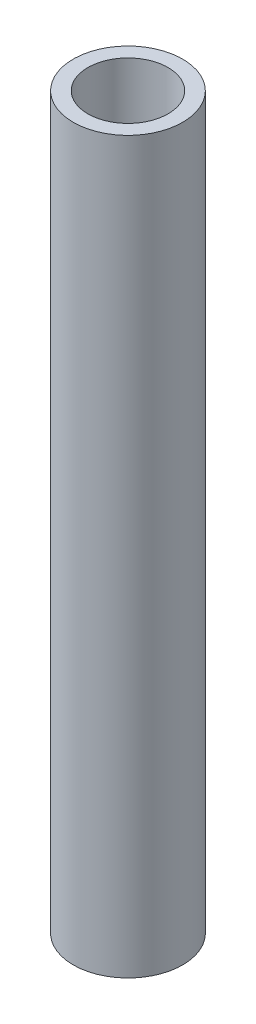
from build123d import *

# Parameters (mm, degrees)
SKETCH1_R      = 1.5
SKETCH1_R_2    = 1.1
EXTRUDE1_DEPTH = 20


with BuildPart() as part:
    # Sketch1 → Extrude1 (new body)
    with BuildSketch(Plane(origin=(0, 0, 0), x_dir=(1, 0, 0), z_dir=(0, 1, 0))):
        with Locations(Location((0, 0, 0), (0, 0, 270))):
            Circle(SKETCH1_R)
        with Locations(Location((0, 0, 0), (0, 0, 270))):
            Circle(SKETCH1_R_2, mode=Mode.SUBTRACT)
    extrude(amount=EXTRUDE1_DEPTH)


solid = part.part
